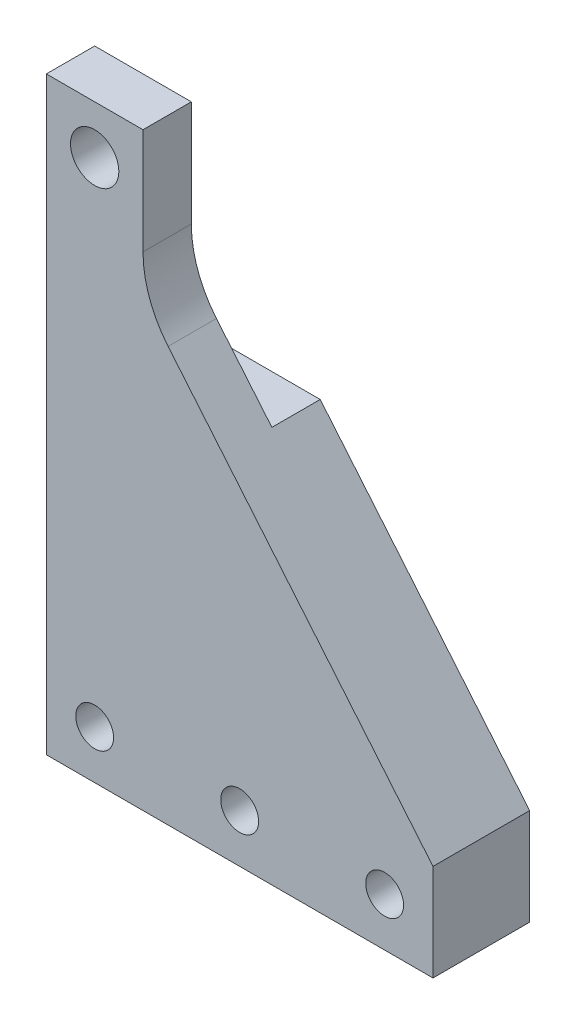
ISO-10303-21;
HEADER;
FILE_DESCRIPTION(('STEP AP214'),'2;1');
FILE_NAME('part.step','',(''),(''),'','','');
FILE_SCHEMA(('AUTOMOTIVE_DESIGN { 1 0 10303 214 1 1 1 1 }'));
ENDSEC;
DATA;
#1=APPLICATION_CONTEXT('core data for automotive mechanical design processes');
#2=APPLICATION_PROTOCOL_DEFINITION('international standard','automotive_design',2000,#1);
#3=PRODUCT_CONTEXT('',#1,'mechanical');
#4=PRODUCT('Part','Part','',(#3));
#5=PRODUCT_RELATED_PRODUCT_CATEGORY('part','',(#4));
#6=PRODUCT_DEFINITION_FORMATION('','',#4);
#7=PRODUCT_DEFINITION_CONTEXT('part definition',#1,'design');
#8=PRODUCT_DEFINITION('design','',#6,#7);
#9=PRODUCT_DEFINITION_SHAPE('','',#8);
#10=(LENGTH_UNIT() NAMED_UNIT(*) SI_UNIT(.MILLI.,.METRE.));
#11=(NAMED_UNIT(*) PLANE_ANGLE_UNIT() SI_UNIT($,.RADIAN.));
#12=(NAMED_UNIT(*) SI_UNIT($,.STERADIAN.) SOLID_ANGLE_UNIT());
#13=UNCERTAINTY_MEASURE_WITH_UNIT(LENGTH_MEASURE(1.E-05),#10,'distance_accuracy_value','');
#14=(GEOMETRIC_REPRESENTATION_CONTEXT(3) GLOBAL_UNCERTAINTY_ASSIGNED_CONTEXT((#13)) GLOBAL_UNIT_ASSIGNED_CONTEXT((#10,
#11,#12)) REPRESENTATION_CONTEXT('',''));
#15=CARTESIAN_POINT('',(0.,0.,0.));
#16=DIRECTION('',(0.,0.,1.));
#17=DIRECTION('',(1.,0.,0.));
#18=AXIS2_PLACEMENT_3D('',#15,#16,#17);
#19=CARTESIAN_POINT('',(-6.35,71.12,12.7));
#20=DIRECTION('',(0.,-1.,0.));
#21=DIRECTION('',(0.,0.,-1.));
#22=AXIS2_PLACEMENT_3D('',#19,#20,#21);
#23=PLANE('',#22);
#24=DIRECTION('',(1.,0.,0.));
#25=VECTOR('',#24,1.);
#26=CARTESIAN_POINT('',(0.,71.12,6.35));
#27=LINE('',#26,#25);
#28=CARTESIAN_POINT('',(-6.35,71.12,6.35));
#29=VERTEX_POINT('',#28);
#30=CARTESIAN_POINT('',(6.35,71.12,6.35));
#31=VERTEX_POINT('',#30);
#32=EDGE_CURVE('E130',#29,#31,#27,.T.);
#33=ORIENTED_EDGE('',*,*,#32,.F.);
#34=DIRECTION('',(0.,0.,-1.));
#35=VECTOR('',#34,1.);
#36=CARTESIAN_POINT('',(-6.35,71.12,12.7));
#37=LINE('',#36,#35);
#38=CARTESIAN_POINT('',(-6.35,71.12,12.7));
#39=VERTEX_POINT('',#38);
#40=EDGE_CURVE('E182',#39,#29,#37,.T.);
#41=ORIENTED_EDGE('',*,*,#40,.F.);
#42=DIRECTION('',(-1.,0.,0.));
#43=VECTOR('',#42,1.);
#44=CARTESIAN_POINT('',(-6.35,71.12,12.7));
#45=LINE('',#44,#43);
#46=CARTESIAN_POINT('',(6.35,71.12,12.7));
#47=VERTEX_POINT('',#46);
#48=EDGE_CURVE('E180',#47,#39,#45,.T.);
#49=ORIENTED_EDGE('',*,*,#48,.F.);
#50=DIRECTION('',(0.,0.,1.));
#51=VECTOR('',#50,1.);
#52=CARTESIAN_POINT('',(6.35,71.12,0.));
#53=LINE('',#52,#51);
#54=EDGE_CURVE('E145',#31,#47,#53,.T.);
#55=ORIENTED_EDGE('',*,*,#54,.F.);
#56=EDGE_LOOP('',(#33,#41,#49,#55));
#57=FACE_BOUND('',#56,.T.);
#58=ADVANCED_FACE('F35',(#57),#23,.F.);
#59=CARTESIAN_POINT('',(0.,64.77,12.7));
#60=DIRECTION('',(0.,0.,-1.));
#61=DIRECTION('',(-1.,0.,0.));
#62=AXIS2_PLACEMENT_3D('',#59,#60,#61);
#63=CYLINDRICAL_SURFACE('',#62,3.175);
#64=CARTESIAN_POINT('',(0.,64.77,12.7));
#65=DIRECTION('',(0.,0.,1.));
#66=DIRECTION('',(1.,0.,0.));
#67=AXIS2_PLACEMENT_3D('',#64,#65,#66);
#68=CIRCLE('',#67,3.175);
#69=CARTESIAN_POINT('',(3.175,64.77,12.7));
#70=VERTEX_POINT('',#69);
#71=EDGE_CURVE('E147',#70,#70,#68,.T.);
#72=ORIENTED_EDGE('',*,*,#71,.T.);
#73=EDGE_LOOP('',(#72));
#74=FACE_BOUND('',#73,.T.);
#75=CARTESIAN_POINT('',(0.,64.77,6.35));
#76=DIRECTION('',(0.,0.,-1.));
#77=DIRECTION('',(-1.,0.,0.));
#78=AXIS2_PLACEMENT_3D('',#75,#76,#77);
#79=CIRCLE('',#78,3.175);
#80=CARTESIAN_POINT('',(-3.175,64.77,6.35));
#81=VERTEX_POINT('',#80);
#82=EDGE_CURVE('E132',#81,#81,#79,.T.);
#83=ORIENTED_EDGE('',*,*,#82,.T.);
#84=EDGE_LOOP('',(#83));
#85=FACE_BOUND('',#84,.T.);
#86=ADVANCED_FACE('F231',(#74,#85),#63,.F.);
#87=CARTESIAN_POINT('',(6.35,52.07,0.));
#88=DIRECTION('',(-1.,0.,0.));
#89=DIRECTION('',(0.,0.,1.));
#90=AXIS2_PLACEMENT_3D('',#87,#88,#89);
#91=PLANE('',#90);
#92=DIRECTION('',(0.,-1.,0.));
#93=VECTOR('',#92,1.);
#94=CARTESIAN_POINT('',(6.35,52.07,12.7));
#95=LINE('',#94,#93);
#96=CARTESIAN_POINT('',(6.35,57.2197982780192,12.7));
#97=VERTEX_POINT('',#96);
#98=EDGE_CURVE('E139',#47,#97,#95,.T.);
#99=ORIENTED_EDGE('',*,*,#98,.T.);
#100=DIRECTION('',(0.,0.,1.));
#101=VECTOR('',#100,1.);
#102=CARTESIAN_POINT('',(6.35,57.2197982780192,6.35));
#103=LINE('',#102,#101);
#104=CARTESIAN_POINT('',(6.35,57.2197982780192,6.35));
#105=VERTEX_POINT('',#104);
#106=EDGE_CURVE('E56',#97,#105,#103,.F.);
#107=ORIENTED_EDGE('',*,*,#106,.T.);
#108=DIRECTION('',(0.,-1.,0.));
#109=VECTOR('',#108,1.);
#110=CARTESIAN_POINT('',(6.35,0.,6.35));
#111=LINE('',#110,#109);
#112=EDGE_CURVE('E116',#31,#105,#111,.T.);
#113=ORIENTED_EDGE('',*,*,#112,.F.);
#114=ORIENTED_EDGE('',*,*,#54,.T.);
#115=EDGE_LOOP('',(#99,#107,#113,#114));
#116=FACE_BOUND('',#115,.T.);
#117=ADVANCED_FACE('F223',(#116),#91,.F.);
#118=CARTESIAN_POINT('',(0.,0.,12.7));
#119=DIRECTION('',(0.,0.,-1.));
#120=DIRECTION('',(-1.,0.,0.));
#121=AXIS2_PLACEMENT_3D('',#118,#119,#120);
#122=PLANE('',#121);
#123=DIRECTION('',(0.64018439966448,-0.768221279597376,0.));
#124=VECTOR('',#123,1.);
#125=CARTESIAN_POINT('',(44.45,6.35,12.7));
#126=LINE('',#125,#124);
#127=CARTESIAN_POINT('',(9.64682051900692,48.1138153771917,12.7));
#128=VERTEX_POINT('',#127);
#129=CARTESIAN_POINT('',(44.45,6.35,12.7));
#130=VERTEX_POINT('',#129);
#131=EDGE_CURVE('E142',#128,#130,#126,.T.);
#132=ORIENTED_EDGE('',*,*,#131,.F.);
#133=CARTESIAN_POINT('',(20.574,57.2197982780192,12.7));
#134=DIRECTION('',(0.,0.,-1.));
#135=DIRECTION('',(-1.,0.,0.));
#136=AXIS2_PLACEMENT_3D('',#133,#134,#135);
#137=CIRCLE('',#136,14.224);
#138=EDGE_CURVE('E43',#128,#97,#137,.T.);
#139=ORIENTED_EDGE('',*,*,#138,.T.);
#140=ORIENTED_EDGE('',*,*,#98,.F.);
#141=ORIENTED_EDGE('',*,*,#48,.T.);
#142=DIRECTION('',(0.,-1.,0.));
#143=VECTOR('',#142,1.);
#144=CARTESIAN_POINT('',(-6.35,-6.35,12.7));
#145=LINE('',#144,#143);
#146=CARTESIAN_POINT('',(-6.35,-6.35,12.7));
#147=VERTEX_POINT('',#146);
#148=EDGE_CURVE('E171',#39,#147,#145,.T.);
#149=ORIENTED_EDGE('',*,*,#148,.T.);
#150=DIRECTION('',(1.,0.,0.));
#151=VECTOR('',#150,1.);
#152=CARTESIAN_POINT('',(-6.35,-6.35,12.7));
#153=LINE('',#152,#151);
#154=CARTESIAN_POINT('',(44.45,-6.35,12.7));
#155=VERTEX_POINT('',#154);
#156=EDGE_CURVE('E174',#147,#155,#153,.T.);
#157=ORIENTED_EDGE('',*,*,#156,.T.);
#158=DIRECTION('',(0.,1.,0.));
#159=VECTOR('',#158,1.);
#160=CARTESIAN_POINT('',(44.45,-6.35,12.7));
#161=LINE('',#160,#159);
#162=EDGE_CURVE('E177',#155,#130,#161,.T.);
#163=ORIENTED_EDGE('',*,*,#162,.T.);
#164=EDGE_LOOP('',(#132,#139,#140,#141,#149,#157,#163));
#165=FACE_BOUND('',#164,.T.);
#166=CARTESIAN_POINT('',(0.,0.,12.7));
#167=DIRECTION('',(0.,0.,1.));
#168=DIRECTION('',(1.,0.,0.));
#169=AXIS2_PLACEMENT_3D('',#166,#167,#168);
#170=CIRCLE('',#169,2.4892);
#171=CARTESIAN_POINT('',(2.4892,0.,12.7));
#172=VERTEX_POINT('',#171);
#173=EDGE_CURVE('E165',#172,#172,#170,.T.);
#174=ORIENTED_EDGE('',*,*,#173,.F.);
#175=EDGE_LOOP('',(#174));
#176=FACE_BOUND('',#175,.T.);
#177=CARTESIAN_POINT('',(38.1,0.,12.7));
#178=DIRECTION('',(0.,0.,1.));
#179=DIRECTION('',(1.,0.,0.));
#180=AXIS2_PLACEMENT_3D('',#177,#178,#179);
#181=CIRCLE('',#180,2.4892);
#182=CARTESIAN_POINT('',(40.5892,0.,12.7));
#183=VERTEX_POINT('',#182);
#184=EDGE_CURVE('E159',#183,#183,#181,.T.);
#185=ORIENTED_EDGE('',*,*,#184,.F.);
#186=EDGE_LOOP('',(#185));
#187=FACE_BOUND('',#186,.T.);
#188=CARTESIAN_POINT('',(19.05,0.,12.7));
#189=DIRECTION('',(0.,0.,1.));
#190=DIRECTION('',(1.,0.,0.));
#191=AXIS2_PLACEMENT_3D('',#188,#189,#190);
#192=CIRCLE('',#191,2.4892);
#193=CARTESIAN_POINT('',(21.5392,0.,12.7));
#194=VERTEX_POINT('',#193);
#195=EDGE_CURVE('E153',#194,#194,#192,.T.);
#196=ORIENTED_EDGE('',*,*,#195,.F.);
#197=EDGE_LOOP('',(#196));
#198=FACE_BOUND('',#197,.T.);
#199=ORIENTED_EDGE('',*,*,#71,.F.);
#200=EDGE_LOOP('',(#199));
#201=FACE_BOUND('',#200,.T.);
#202=ADVANCED_FACE('F199',(#165,#176,#187,#198,#201),#122,.F.);
#203=CARTESIAN_POINT('',(0.,0.,0.));
#204=DIRECTION('',(0.,0.,-1.));
#205=DIRECTION('',(-1.,0.,0.));
#206=AXIS2_PLACEMENT_3D('',#203,#204,#205);
#207=PLANE('',#206);
#208=DIRECTION('',(-1.,0.,0.));
#209=VECTOR('',#208,1.);
#210=CARTESIAN_POINT('',(0.,39.37,0.));
#211=LINE('',#210,#209);
#212=CARTESIAN_POINT('',(16.9333333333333,39.37,0.));
#213=VERTEX_POINT('',#212);
#214=CARTESIAN_POINT('',(-6.35,39.37,0.));
#215=VERTEX_POINT('',#214);
#216=EDGE_CURVE('E211',#213,#215,#211,.T.);
#217=ORIENTED_EDGE('',*,*,#216,.F.);
#218=DIRECTION('',(0.64018439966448,-0.768221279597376,0.));
#219=VECTOR('',#218,1.);
#220=CARTESIAN_POINT('',(44.45,6.35,0.));
#221=LINE('',#220,#219);
#222=CARTESIAN_POINT('',(44.45,6.35,0.));
#223=VERTEX_POINT('',#222);
#224=EDGE_CURVE('E129',#213,#223,#221,.T.);
#225=ORIENTED_EDGE('',*,*,#224,.T.);
#226=DIRECTION('',(0.,1.,0.));
#227=VECTOR('',#226,1.);
#228=CARTESIAN_POINT('',(44.45,-6.35,0.));
#229=LINE('',#228,#227);
#230=CARTESIAN_POINT('',(44.45,-6.35,0.));
#231=VERTEX_POINT('',#230);
#232=EDGE_CURVE('E175',#231,#223,#229,.T.);
#233=ORIENTED_EDGE('',*,*,#232,.F.);
#234=DIRECTION('',(1.,0.,0.));
#235=VECTOR('',#234,1.);
#236=CARTESIAN_POINT('',(-6.35,-6.35,0.));
#237=LINE('',#236,#235);
#238=CARTESIAN_POINT('',(-6.35,-6.35,0.));
#239=VERTEX_POINT('',#238);
#240=EDGE_CURVE('E184',#239,#231,#237,.T.);
#241=ORIENTED_EDGE('',*,*,#240,.F.);
#242=DIRECTION('',(0.,-1.,0.));
#243=VECTOR('',#242,1.);
#244=CARTESIAN_POINT('',(-6.35,-6.35,0.));
#245=LINE('',#244,#243);
#246=EDGE_CURVE('E168',#215,#239,#245,.T.);
#247=ORIENTED_EDGE('',*,*,#246,.F.);
#248=EDGE_LOOP('',(#217,#225,#233,#241,#247));
#249=FACE_BOUND('',#248,.T.);
#250=CARTESIAN_POINT('',(19.05,0.,0.));
#251=DIRECTION('',(0.,0.,1.));
#252=DIRECTION('',(1.,0.,0.));
#253=AXIS2_PLACEMENT_3D('',#250,#251,#252);
#254=CIRCLE('',#253,2.4892);
#255=CARTESIAN_POINT('',(21.5392,0.,0.));
#256=VERTEX_POINT('',#255);
#257=EDGE_CURVE('E152',#256,#256,#254,.T.);
#258=ORIENTED_EDGE('',*,*,#257,.T.);
#259=EDGE_LOOP('',(#258));
#260=FACE_BOUND('',#259,.T.);
#261=CARTESIAN_POINT('',(0.,0.,0.));
#262=DIRECTION('',(0.,0.,1.));
#263=DIRECTION('',(1.,0.,0.));
#264=AXIS2_PLACEMENT_3D('',#261,#262,#263);
#265=CIRCLE('',#264,2.4892);
#266=CARTESIAN_POINT('',(2.4892,0.,0.));
#267=VERTEX_POINT('',#266);
#268=EDGE_CURVE('E162',#267,#267,#265,.T.);
#269=ORIENTED_EDGE('',*,*,#268,.T.);
#270=EDGE_LOOP('',(#269));
#271=FACE_BOUND('',#270,.T.);
#272=CARTESIAN_POINT('',(38.1,0.,0.));
#273=DIRECTION('',(0.,0.,1.));
#274=DIRECTION('',(1.,0.,0.));
#275=AXIS2_PLACEMENT_3D('',#272,#273,#274);
#276=CIRCLE('',#275,2.4892);
#277=CARTESIAN_POINT('',(40.5892,0.,0.));
#278=VERTEX_POINT('',#277);
#279=EDGE_CURVE('E156',#278,#278,#276,.T.);
#280=ORIENTED_EDGE('',*,*,#279,.T.);
#281=EDGE_LOOP('',(#280));
#282=FACE_BOUND('',#281,.T.);
#283=ADVANCED_FACE('F208',(#249,#260,#271,#282),#207,.T.);
#284=CARTESIAN_POINT('',(-6.35,-6.35,12.7));
#285=DIRECTION('',(1.,0.,0.));
#286=DIRECTION('',(0.,1.,0.));
#287=AXIS2_PLACEMENT_3D('',#284,#285,#286);
#288=PLANE('',#287);
#289=DIRECTION('',(0.,1.,0.));
#290=VECTOR('',#289,1.);
#291=CARTESIAN_POINT('',(-6.35,0.,6.35));
#292=LINE('',#291,#290);
#293=CARTESIAN_POINT('',(-6.35,39.37,6.35));
#294=VERTEX_POINT('',#293);
#295=EDGE_CURVE('E124',#294,#29,#292,.T.);
#296=ORIENTED_EDGE('',*,*,#295,.F.);
#297=DIRECTION('',(0.,0.,-1.));
#298=VECTOR('',#297,1.);
#299=CARTESIAN_POINT('',(-6.35,39.37,6.35));
#300=LINE('',#299,#298);
#301=EDGE_CURVE('E123',#294,#215,#300,.T.);
#302=ORIENTED_EDGE('',*,*,#301,.T.);
#303=ORIENTED_EDGE('',*,*,#246,.T.);
#304=DIRECTION('',(0.,0.,-1.));
#305=VECTOR('',#304,1.);
#306=CARTESIAN_POINT('',(-6.35,-6.35,12.7));
#307=LINE('',#306,#305);
#308=EDGE_CURVE('E193',#147,#239,#307,.T.);
#309=ORIENTED_EDGE('',*,*,#308,.F.);
#310=ORIENTED_EDGE('',*,*,#148,.F.);
#311=ORIENTED_EDGE('',*,*,#40,.T.);
#312=EDGE_LOOP('',(#296,#302,#303,#309,#310,#311));
#313=FACE_BOUND('',#312,.T.);
#314=ADVANCED_FACE('F221',(#313),#288,.F.);
#315=CARTESIAN_POINT('',(-6.35,-6.35,12.7));
#316=DIRECTION('',(0.,1.,0.));
#317=DIRECTION('',(0.,0.,1.));
#318=AXIS2_PLACEMENT_3D('',#315,#316,#317);
#319=PLANE('',#318);
#320=ORIENTED_EDGE('',*,*,#240,.T.);
#321=DIRECTION('',(0.,0.,-1.));
#322=VECTOR('',#321,1.);
#323=CARTESIAN_POINT('',(44.45,-6.35,12.7));
#324=LINE('',#323,#322);
#325=EDGE_CURVE('E190',#155,#231,#324,.T.);
#326=ORIENTED_EDGE('',*,*,#325,.F.);
#327=ORIENTED_EDGE('',*,*,#156,.F.);
#328=ORIENTED_EDGE('',*,*,#308,.T.);
#329=EDGE_LOOP('',(#320,#326,#327,#328));
#330=FACE_BOUND('',#329,.T.);
#331=ADVANCED_FACE('F244',(#330),#319,.F.);
#332=CARTESIAN_POINT('',(44.45,-6.35,12.7));
#333=DIRECTION('',(-1.,0.,0.));
#334=DIRECTION('',(0.,0.,1.));
#335=AXIS2_PLACEMENT_3D('',#332,#333,#334);
#336=PLANE('',#335);
#337=ORIENTED_EDGE('',*,*,#232,.T.);
#338=DIRECTION('',(0.,0.,1.));
#339=VECTOR('',#338,1.);
#340=CARTESIAN_POINT('',(44.45,6.35,0.));
#341=LINE('',#340,#339);
#342=EDGE_CURVE('E141',#223,#130,#341,.T.);
#343=ORIENTED_EDGE('',*,*,#342,.T.);
#344=ORIENTED_EDGE('',*,*,#162,.F.);
#345=ORIENTED_EDGE('',*,*,#325,.T.);
#346=EDGE_LOOP('',(#337,#343,#344,#345));
#347=FACE_BOUND('',#346,.T.);
#348=ADVANCED_FACE('F204',(#347),#336,.F.);
#349=CARTESIAN_POINT('',(0.,0.,12.7));
#350=DIRECTION('',(0.,0.,-1.));
#351=DIRECTION('',(-1.,0.,0.));
#352=AXIS2_PLACEMENT_3D('',#349,#350,#351);
#353=CYLINDRICAL_SURFACE('',#352,2.4892);
#354=ORIENTED_EDGE('',*,*,#173,.T.);
#355=EDGE_LOOP('',(#354));
#356=FACE_BOUND('',#355,.T.);
#357=ORIENTED_EDGE('',*,*,#268,.F.);
#358=EDGE_LOOP('',(#357));
#359=FACE_BOUND('',#358,.T.);
#360=ADVANCED_FACE('F243',(#356,#359),#353,.F.);
#361=CARTESIAN_POINT('',(38.1,0.,12.7));
#362=DIRECTION('',(0.,0.,-1.));
#363=DIRECTION('',(-1.,0.,0.));
#364=AXIS2_PLACEMENT_3D('',#361,#362,#363);
#365=CYLINDRICAL_SURFACE('',#364,2.4892);
#366=ORIENTED_EDGE('',*,*,#184,.T.);
#367=EDGE_LOOP('',(#366));
#368=FACE_BOUND('',#367,.T.);
#369=ORIENTED_EDGE('',*,*,#279,.F.);
#370=EDGE_LOOP('',(#369));
#371=FACE_BOUND('',#370,.T.);
#372=ADVANCED_FACE('F261',(#368,#371),#365,.F.);
#373=CARTESIAN_POINT('',(19.05,0.,12.7));
#374=DIRECTION('',(0.,0.,-1.));
#375=DIRECTION('',(-1.,0.,0.));
#376=AXIS2_PLACEMENT_3D('',#373,#374,#375);
#377=CYLINDRICAL_SURFACE('',#376,2.4892);
#378=ORIENTED_EDGE('',*,*,#195,.T.);
#379=EDGE_LOOP('',(#378));
#380=FACE_BOUND('',#379,.T.);
#381=ORIENTED_EDGE('',*,*,#257,.F.);
#382=EDGE_LOOP('',(#381));
#383=FACE_BOUND('',#382,.T.);
#384=ADVANCED_FACE('F265',(#380,#383),#377,.F.);
#385=CARTESIAN_POINT('',(44.45,6.35,0.));
#386=DIRECTION('',(-0.768221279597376,-0.64018439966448,0.));
#387=DIRECTION('',(0.64018439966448,-0.768221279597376,0.));
#388=AXIS2_PLACEMENT_3D('',#385,#386,#387);
#389=PLANE('',#388);
#390=DIRECTION('',(0.64018439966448,-0.768221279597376,0.));
#391=VECTOR('',#390,1.);
#392=CARTESIAN_POINT('',(29.355737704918,24.4631147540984,6.35));
#393=LINE('',#392,#391);
#394=CARTESIAN_POINT('',(9.64682051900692,48.1138153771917,6.35));
#395=VERTEX_POINT('',#394);
#396=CARTESIAN_POINT('',(16.9333333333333,39.37,6.35));
#397=VERTEX_POINT('',#396);
#398=EDGE_CURVE('E106',#395,#397,#393,.T.);
#399=ORIENTED_EDGE('',*,*,#398,.F.);
#400=DIRECTION('',(0.,0.,1.));
#401=VECTOR('',#400,1.);
#402=CARTESIAN_POINT('',(9.64682051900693,48.1138153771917,12.7));
#403=LINE('',#402,#401);
#404=EDGE_CURVE('E196',#395,#128,#403,.T.);
#405=ORIENTED_EDGE('',*,*,#404,.T.);
#406=ORIENTED_EDGE('',*,*,#131,.T.);
#407=ORIENTED_EDGE('',*,*,#342,.F.);
#408=ORIENTED_EDGE('',*,*,#224,.F.);
#409=DIRECTION('',(0.,0.,-1.));
#410=VECTOR('',#409,1.);
#411=CARTESIAN_POINT('',(16.9333333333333,39.37,6.35));
#412=LINE('',#411,#410);
#413=EDGE_CURVE('E120',#397,#213,#412,.T.);
#414=ORIENTED_EDGE('',*,*,#413,.F.);
#415=EDGE_LOOP('',(#399,#405,#406,#407,#408,#414));
#416=FACE_BOUND('',#415,.T.);
#417=ADVANCED_FACE('F127',(#416),#389,.F.);
#418=CARTESIAN_POINT('',(0.,39.37,6.35));
#419=DIRECTION('',(0.,-1.,0.));
#420=DIRECTION('',(0.,0.,-1.));
#421=AXIS2_PLACEMENT_3D('',#418,#419,#420);
#422=PLANE('',#421);
#423=ORIENTED_EDGE('',*,*,#216,.T.);
#424=ORIENTED_EDGE('',*,*,#301,.F.);
#425=DIRECTION('',(-1.,0.,0.));
#426=VECTOR('',#425,1.);
#427=CARTESIAN_POINT('',(0.,39.37,6.35));
#428=LINE('',#427,#426);
#429=EDGE_CURVE('E109',#397,#294,#428,.T.);
#430=ORIENTED_EDGE('',*,*,#429,.F.);
#431=ORIENTED_EDGE('',*,*,#413,.T.);
#432=EDGE_LOOP('',(#423,#424,#430,#431));
#433=FACE_BOUND('',#432,.T.);
#434=ADVANCED_FACE('F119',(#433),#422,.F.);
#435=CARTESIAN_POINT('',(0.,0.,6.35));
#436=DIRECTION('',(0.,0.,-1.));
#437=DIRECTION('',(-1.,0.,0.));
#438=AXIS2_PLACEMENT_3D('',#435,#436,#437);
#439=PLANE('',#438);
#440=ORIENTED_EDGE('',*,*,#82,.F.);
#441=EDGE_LOOP('',(#440));
#442=FACE_BOUND('',#441,.T.);
#443=ORIENTED_EDGE('',*,*,#112,.T.);
#444=CARTESIAN_POINT('',(20.574,57.2197982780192,6.35));
#445=DIRECTION('',(0.,0.,-1.));
#446=DIRECTION('',(-1.,0.,0.));
#447=AXIS2_PLACEMENT_3D('',#444,#445,#446);
#448=CIRCLE('',#447,14.224);
#449=EDGE_CURVE('E11',#105,#395,#448,.F.);
#450=ORIENTED_EDGE('',*,*,#449,.T.);
#451=ORIENTED_EDGE('',*,*,#398,.T.);
#452=ORIENTED_EDGE('',*,*,#429,.T.);
#453=ORIENTED_EDGE('',*,*,#295,.T.);
#454=ORIENTED_EDGE('',*,*,#32,.T.);
#455=EDGE_LOOP('',(#443,#450,#451,#452,#453,#454));
#456=FACE_BOUND('',#455,.T.);
#457=ADVANCED_FACE('F108',(#442,#456),#439,.T.);
#458=CARTESIAN_POINT('',(20.574,57.2197982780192,0.));
#459=DIRECTION('',(0.,0.,-1.));
#460=DIRECTION('',(-1.,0.,0.));
#461=AXIS2_PLACEMENT_3D('',#458,#459,#460);
#462=CYLINDRICAL_SURFACE('',#461,14.224);
#463=ORIENTED_EDGE('',*,*,#449,.F.);
#464=ORIENTED_EDGE('',*,*,#106,.F.);
#465=ORIENTED_EDGE('',*,*,#138,.F.);
#466=ORIENTED_EDGE('',*,*,#404,.F.);
#467=EDGE_LOOP('',(#463,#464,#465,#466));
#468=FACE_BOUND('',#467,.T.);
#469=ADVANCED_FACE('F37',(#468),#462,.F.);
#470=CLOSED_SHELL('',(#58,#86,#117,#202,#283,#314,#331,#348,#360,#372,#384,#417,#434,#457,#469));
#471=MANIFOLD_SOLID_BREP('B2',#470);
#472=ADVANCED_BREP_SHAPE_REPRESENTATION('',(#18,#471),#14);
#473=SHAPE_DEFINITION_REPRESENTATION(#9,#472);
ENDSEC;
END-ISO-10303-21;
